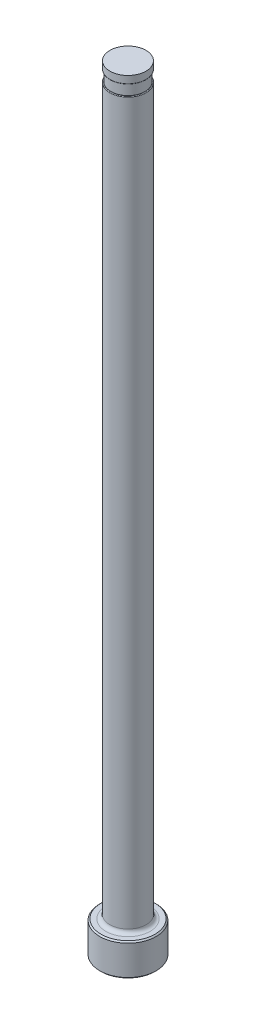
from build123d import *

# Parameters (mm, degrees)
CHAMFER1_SIZE     = 0.254
FILLET1_R         = 0.762
SKETCH2_W         = 0.2032
SKETCH2_H         = 2.032
D_SLOT_DEPTH      = 153.60197502
D_SLOT_DEPTH_BACK = 153.60197502
SKETCH5_W         = 0.0254
SKETCH5_H         = 1.524
FILLET2_R         = 0.127


with BuildPart() as part:
    # Sketch1 → Revolve1 (revolve)
    with BuildSketch(Plane.XY, mode=Mode.PRIVATE) as revolve1_sk:
        Polygon((0, 0), (-5.5499, 0), (-5.5499, 6.35), (-3.57124, 6.35), (-3.57124, 152.4), (0, 152.4), align=None)
    revolve(revolve1_sk.sketch.rotate(Axis((0, 259.958771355, 0), (0, -1, 0)), 270), axis=Axis((0, 259.958771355, 0), (0, -1, 0)))

    # Chamfer1
    chamfer1_edges = [part.edges().sort_by_distance(p)[0] for p in [
        (0, 6.35, -5.5499),
        (0, 0, -5.5499),
    ]]
    chamfer(chamfer1_edges, length=CHAMFER1_SIZE)

    # Fillet1
    fillet1_edges = [part.edges().sort_by_distance(p)[0] for p in [
        (0, 6.35, -3.57124),
    ]]
    fillet(fillet1_edges, radius=FILLET1_R)

    # Sketch2 → Vent Relief (revolve, cut)
    with BuildSketch(Plane.XY, mode=Mode.PRIVATE) as vent_relief_sk:
        with Locations((-3.46964, 149.86)):
            Rectangle(SKETCH2_W, SKETCH2_H)
    revolve(vent_relief_sk.sketch.rotate(Axis((0, 153.448281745, 0), (0, -1, 0)), 270), axis=Axis((0, 153.448281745, 0), (0, -1, 0)), mode=Mode.SUBTRACT)

    # Sketch3 → D-Slot (cut, two sides: drawn at the far end of the back side and taken through both)
    with BuildSketch(Plane.XY.offset(-D_SLOT_DEPTH_BACK)):
        with BuildLine():
            Line((-3.36804, 149.86), (-3.36804, 86.36))
            ThreePointArc((-3.36804, 86.36), (-3.419253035, 85.792038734), (-3.57124, 85.2424))
            Line((-3.57124, 85.2424), (-3.57124, 149.86))
            Line((-3.57124, 149.86), (-3.36804, 149.86))
        make_face()
    extrude(amount=D_SLOT_DEPTH + D_SLOT_DEPTH_BACK, mode=Mode.SUBTRACT)

    # Sketch5 → Vent Diameter (revolve, cut)
    with BuildSketch(Plane.XY, mode=Mode.PRIVATE) as vent_diameter_sk:
        with Locations((-3.55854, 151.638)):
            Rectangle(SKETCH5_W, SKETCH5_H)
    revolve(vent_diameter_sk.sketch.rotate(Axis((0, 152.687735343, 0), (0, -1, 0)), 90), axis=Axis((0, 152.687735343, 0), (0, -1, 0)), mode=Mode.SUBTRACT)

    # Fillet2
    fillet2_edges = [part.edges().sort_by_distance(p)[0] for p in [
        (2.915000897, 148.844, -2.063134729),
        (0, 150.876, 3.54584),
    ]]
    fillet(fillet2_edges, radius=FILLET2_R)


solid = part.part
